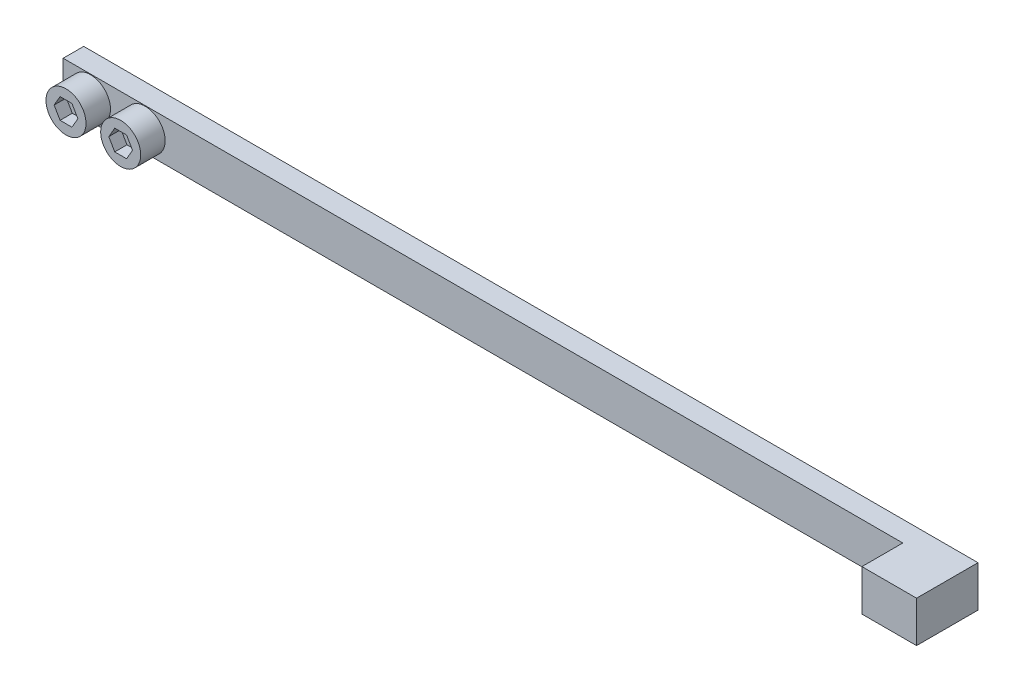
ISO-10303-21;
HEADER;
FILE_DESCRIPTION(('STEP AP214'),'2;1');
FILE_NAME('part.step','',(''),(''),'','','');
FILE_SCHEMA(('AUTOMOTIVE_DESIGN { 1 0 10303 214 1 1 1 1 }'));
ENDSEC;
DATA;
#1=APPLICATION_CONTEXT('core data for automotive mechanical design processes');
#2=APPLICATION_PROTOCOL_DEFINITION('international standard','automotive_design',2000,#1);
#3=PRODUCT_CONTEXT('',#1,'mechanical');
#4=PRODUCT('Part','Part','',(#3));
#5=PRODUCT_RELATED_PRODUCT_CATEGORY('part','',(#4));
#6=PRODUCT_DEFINITION_FORMATION('','',#4);
#7=PRODUCT_DEFINITION_CONTEXT('part definition',#1,'design');
#8=PRODUCT_DEFINITION('design','',#6,#7);
#9=PRODUCT_DEFINITION_SHAPE('','',#8);
#10=(LENGTH_UNIT() NAMED_UNIT(*) SI_UNIT(.MILLI.,.METRE.));
#11=(NAMED_UNIT(*) PLANE_ANGLE_UNIT() SI_UNIT($,.RADIAN.));
#12=(NAMED_UNIT(*) SI_UNIT($,.STERADIAN.) SOLID_ANGLE_UNIT());
#13=UNCERTAINTY_MEASURE_WITH_UNIT(LENGTH_MEASURE(1.E-05),#10,'distance_accuracy_value','');
#14=(GEOMETRIC_REPRESENTATION_CONTEXT(3) GLOBAL_UNCERTAINTY_ASSIGNED_CONTEXT((#13)) GLOBAL_UNIT_ASSIGNED_CONTEXT((#10,
#11,#12)) REPRESENTATION_CONTEXT('',''));
#15=CARTESIAN_POINT('',(0.,0.,0.));
#16=DIRECTION('',(0.,0.,1.));
#17=DIRECTION('',(1.,0.,0.));
#18=AXIS2_PLACEMENT_3D('',#15,#16,#17);
#19=CARTESIAN_POINT('',(-63.8048,2.3876,1.1938));
#20=DIRECTION('',(0.,0.,-1.));
#21=DIRECTION('',(-1.,0.,0.));
#22=AXIS2_PLACEMENT_3D('',#19,#20,#21);
#23=PLANE('',#22);
#24=CARTESIAN_POINT('',(-60.6298,0.,1.1938));
#25=DIRECTION('',(0.,0.,-1.));
#26=DIRECTION('',(-1.,0.,0.));
#27=AXIS2_PLACEMENT_3D('',#24,#25,#26);
#28=CIRCLE('',#27,2.3241);
#29=CARTESIAN_POINT('',(-62.9539,0.,1.1938));
#30=VERTEX_POINT('',#29);
#31=EDGE_CURVE('E41',#30,#30,#28,.F.);
#32=ORIENTED_EDGE('',*,*,#31,.F.);
#33=EDGE_LOOP('',(#32));
#34=FACE_BOUND('',#33,.T.);
#35=DIRECTION('',(1.,0.,0.));
#36=VECTOR('',#35,1.);
#37=CARTESIAN_POINT('',(-63.8048,-2.3876,1.1938));
#38=LINE('',#37,#36);
#39=CARTESIAN_POINT('',(-63.8048,-2.3876,1.1938));
#40=VERTEX_POINT('',#39);
#41=CARTESIAN_POINT('',(33.7312,-2.3876,1.1938));
#42=VERTEX_POINT('',#41);
#43=EDGE_CURVE('E284',#40,#42,#38,.T.);
#44=ORIENTED_EDGE('',*,*,#43,.T.);
#45=DIRECTION('',(0.,-1.,0.));
#46=VECTOR('',#45,1.);
#47=CARTESIAN_POINT('',(33.7312,2.3876,1.1938));
#48=LINE('',#47,#46);
#49=CARTESIAN_POINT('',(33.7312,2.3876,1.1938));
#50=VERTEX_POINT('',#49);
#51=EDGE_CURVE('E299',#50,#42,#48,.T.);
#52=ORIENTED_EDGE('',*,*,#51,.F.);
#53=DIRECTION('',(1.,0.,0.));
#54=VECTOR('',#53,1.);
#55=CARTESIAN_POINT('',(-63.8048,2.3876,1.1938));
#56=LINE('',#55,#54);
#57=CARTESIAN_POINT('',(-63.8048,2.3876,1.1938));
#58=VERTEX_POINT('',#57);
#59=EDGE_CURVE('E271',#58,#50,#56,.T.);
#60=ORIENTED_EDGE('',*,*,#59,.F.);
#61=DIRECTION('',(0.,-1.,0.));
#62=VECTOR('',#61,1.);
#63=CARTESIAN_POINT('',(-63.8048,2.3876,1.1938));
#64=LINE('',#63,#62);
#65=EDGE_CURVE('E302',#58,#40,#64,.T.);
#66=ORIENTED_EDGE('',*,*,#65,.T.);
#67=EDGE_LOOP('',(#44,#52,#60,#66));
#68=FACE_BOUND('',#67,.T.);
#69=CARTESIAN_POINT('',(-54.2798,0.,1.1938));
#70=DIRECTION('',(0.,0.,-1.));
#71=DIRECTION('',(-1.,0.,0.));
#72=AXIS2_PLACEMENT_3D('',#69,#70,#71);
#73=CIRCLE('',#72,2.3241);
#74=CARTESIAN_POINT('',(-56.6039,0.,1.1938));
#75=VERTEX_POINT('',#74);
#76=EDGE_CURVE('E11',#75,#75,#73,.F.);
#77=ORIENTED_EDGE('',*,*,#76,.F.);
#78=EDGE_LOOP('',(#77));
#79=FACE_BOUND('',#78,.T.);
#80=ADVANCED_FACE('F33',(#34,#68,#79),#23,.F.);
#81=CARTESIAN_POINT('',(40.0812,2.3876,-1.1938));
#82=DIRECTION('',(0.,0.,1.));
#83=DIRECTION('',(1.,0.,0.));
#84=AXIS2_PLACEMENT_3D('',#81,#82,#83);
#85=PLANE('',#84);
#86=DIRECTION('',(-1.,0.,0.));
#87=VECTOR('',#86,1.);
#88=CARTESIAN_POINT('',(40.0812,-2.3876,-1.1938));
#89=LINE('',#88,#87);
#90=CARTESIAN_POINT('',(40.0812,-2.3876,-1.1938));
#91=VERTEX_POINT('',#90);
#92=CARTESIAN_POINT('',(-63.8048,-2.3876,-1.1938));
#93=VERTEX_POINT('',#92);
#94=EDGE_CURVE('E264',#91,#93,#89,.T.);
#95=ORIENTED_EDGE('',*,*,#94,.T.);
#96=DIRECTION('',(0.,-1.,0.));
#97=VECTOR('',#96,1.);
#98=CARTESIAN_POINT('',(-63.8048,2.3876,-1.1938));
#99=LINE('',#98,#97);
#100=CARTESIAN_POINT('',(-63.8048,2.3876,-1.1938));
#101=VERTEX_POINT('',#100);
#102=EDGE_CURVE('E305',#101,#93,#99,.T.);
#103=ORIENTED_EDGE('',*,*,#102,.F.);
#104=DIRECTION('',(-1.,0.,0.));
#105=VECTOR('',#104,1.);
#106=CARTESIAN_POINT('',(40.0812,2.3876,-1.1938));
#107=LINE('',#106,#105);
#108=CARTESIAN_POINT('',(40.0812,2.3876,-1.1938));
#109=VERTEX_POINT('',#108);
#110=EDGE_CURVE('E265',#109,#101,#107,.T.);
#111=ORIENTED_EDGE('',*,*,#110,.F.);
#112=DIRECTION('',(0.,-1.,0.));
#113=VECTOR('',#112,1.);
#114=CARTESIAN_POINT('',(40.0812,2.3876,-1.1938));
#115=LINE('',#114,#113);
#116=EDGE_CURVE('E279',#109,#91,#115,.T.);
#117=ORIENTED_EDGE('',*,*,#116,.T.);
#118=EDGE_LOOP('',(#95,#103,#111,#117));
#119=FACE_BOUND('',#118,.T.);
#120=ADVANCED_FACE('F35',(#119),#85,.F.);
#121=CARTESIAN_POINT('',(-63.8048,2.3876,-1.1938));
#122=DIRECTION('',(1.,0.,0.));
#123=DIRECTION('',(0.,0.,-1.));
#124=AXIS2_PLACEMENT_3D('',#121,#122,#123);
#125=PLANE('',#124);
#126=DIRECTION('',(0.,0.,1.));
#127=VECTOR('',#126,1.);
#128=CARTESIAN_POINT('',(-63.8048,-2.3876,-1.1938));
#129=LINE('',#128,#127);
#130=EDGE_CURVE('E282',#93,#40,#129,.T.);
#131=ORIENTED_EDGE('',*,*,#130,.T.);
#132=ORIENTED_EDGE('',*,*,#65,.F.);
#133=DIRECTION('',(0.,0.,1.));
#134=VECTOR('',#133,1.);
#135=CARTESIAN_POINT('',(-63.8048,2.3876,-1.1938));
#136=LINE('',#135,#134);
#137=EDGE_CURVE('E268',#101,#58,#136,.T.);
#138=ORIENTED_EDGE('',*,*,#137,.F.);
#139=ORIENTED_EDGE('',*,*,#102,.T.);
#140=EDGE_LOOP('',(#131,#132,#138,#139));
#141=FACE_BOUND('',#140,.T.);
#142=ADVANCED_FACE('F359',(#141),#125,.F.);
#143=CARTESIAN_POINT('',(33.7312,2.3876,1.1938));
#144=DIRECTION('',(1.,0.,0.));
#145=DIRECTION('',(0.,0.,-1.));
#146=AXIS2_PLACEMENT_3D('',#143,#144,#145);
#147=PLANE('',#146);
#148=DIRECTION('',(0.,0.,1.));
#149=VECTOR('',#148,1.);
#150=CARTESIAN_POINT('',(33.7312,-2.3876,1.1938));
#151=LINE('',#150,#149);
#152=CARTESIAN_POINT('',(33.7312,-2.3876,5.9436));
#153=VERTEX_POINT('',#152);
#154=EDGE_CURVE('E286',#42,#153,#151,.T.);
#155=ORIENTED_EDGE('',*,*,#154,.T.);
#156=DIRECTION('',(0.,-1.,0.));
#157=VECTOR('',#156,1.);
#158=CARTESIAN_POINT('',(33.7312,2.3876,5.9436));
#159=LINE('',#158,#157);
#160=CARTESIAN_POINT('',(33.7312,2.3876,5.9436));
#161=VERTEX_POINT('',#160);
#162=EDGE_CURVE('E296',#161,#153,#159,.T.);
#163=ORIENTED_EDGE('',*,*,#162,.F.);
#164=DIRECTION('',(0.,0.,1.));
#165=VECTOR('',#164,1.);
#166=CARTESIAN_POINT('',(33.7312,2.3876,1.1938));
#167=LINE('',#166,#165);
#168=EDGE_CURVE('E273',#50,#161,#167,.T.);
#169=ORIENTED_EDGE('',*,*,#168,.F.);
#170=ORIENTED_EDGE('',*,*,#51,.T.);
#171=EDGE_LOOP('',(#155,#163,#169,#170));
#172=FACE_BOUND('',#171,.T.);
#173=ADVANCED_FACE('F356',(#172),#147,.F.);
#174=CARTESIAN_POINT('',(33.7312,2.3876,5.9436));
#175=DIRECTION('',(0.,0.,-1.));
#176=DIRECTION('',(-1.,0.,0.));
#177=AXIS2_PLACEMENT_3D('',#174,#175,#176);
#178=PLANE('',#177);
#179=DIRECTION('',(1.,0.,0.));
#180=VECTOR('',#179,1.);
#181=CARTESIAN_POINT('',(33.7312,-2.3876,5.9436));
#182=LINE('',#181,#180);
#183=CARTESIAN_POINT('',(40.0812,-2.3876,5.9436));
#184=VERTEX_POINT('',#183);
#185=EDGE_CURVE('E288',#153,#184,#182,.T.);
#186=ORIENTED_EDGE('',*,*,#185,.T.);
#187=DIRECTION('',(0.,-1.,0.));
#188=VECTOR('',#187,1.);
#189=CARTESIAN_POINT('',(40.0812,2.3876,5.9436));
#190=LINE('',#189,#188);
#191=CARTESIAN_POINT('',(40.0812,2.3876,5.9436));
#192=VERTEX_POINT('',#191);
#193=EDGE_CURVE('E293',#192,#184,#190,.T.);
#194=ORIENTED_EDGE('',*,*,#193,.F.);
#195=DIRECTION('',(1.,0.,0.));
#196=VECTOR('',#195,1.);
#197=CARTESIAN_POINT('',(33.7312,2.3876,5.9436));
#198=LINE('',#197,#196);
#199=EDGE_CURVE('E275',#161,#192,#198,.T.);
#200=ORIENTED_EDGE('',*,*,#199,.F.);
#201=ORIENTED_EDGE('',*,*,#162,.T.);
#202=EDGE_LOOP('',(#186,#194,#200,#201));
#203=FACE_BOUND('',#202,.T.);
#204=ADVANCED_FACE('F352',(#203),#178,.F.);
#205=CARTESIAN_POINT('',(40.0812,2.3876,5.9436));
#206=DIRECTION('',(-1.,0.,0.));
#207=DIRECTION('',(0.,0.,1.));
#208=AXIS2_PLACEMENT_3D('',#205,#206,#207);
#209=PLANE('',#208);
#210=DIRECTION('',(0.,0.,-1.));
#211=VECTOR('',#210,1.);
#212=CARTESIAN_POINT('',(40.0812,-2.3876,5.9436));
#213=LINE('',#212,#211);
#214=EDGE_CURVE('E269',#184,#91,#213,.T.);
#215=ORIENTED_EDGE('',*,*,#214,.T.);
#216=ORIENTED_EDGE('',*,*,#116,.F.);
#217=DIRECTION('',(0.,0.,-1.));
#218=VECTOR('',#217,1.);
#219=CARTESIAN_POINT('',(40.0812,2.3876,5.9436));
#220=LINE('',#219,#218);
#221=EDGE_CURVE('E277',#192,#109,#220,.T.);
#222=ORIENTED_EDGE('',*,*,#221,.F.);
#223=ORIENTED_EDGE('',*,*,#193,.T.);
#224=EDGE_LOOP('',(#215,#216,#222,#223));
#225=FACE_BOUND('',#224,.T.);
#226=ADVANCED_FACE('F345',(#225),#209,.F.);
#227=CARTESIAN_POINT('',(-63.8048,2.3876,-1.1938));
#228=DIRECTION('',(0.,1.,0.));
#229=DIRECTION('',(0.,0.,1.));
#230=AXIS2_PLACEMENT_3D('',#227,#228,#229);
#231=PLANE('',#230);
#232=ORIENTED_EDGE('',*,*,#110,.T.);
#233=ORIENTED_EDGE('',*,*,#137,.T.);
#234=ORIENTED_EDGE('',*,*,#59,.T.);
#235=ORIENTED_EDGE('',*,*,#168,.T.);
#236=ORIENTED_EDGE('',*,*,#199,.T.);
#237=ORIENTED_EDGE('',*,*,#221,.T.);
#238=EDGE_LOOP('',(#232,#233,#234,#235,#236,#237));
#239=FACE_BOUND('',#238,.T.);
#240=ADVANCED_FACE('F342',(#239),#231,.T.);
#241=CARTESIAN_POINT('',(-63.8048,-2.3876,-1.1938));
#242=DIRECTION('',(0.,1.,0.));
#243=DIRECTION('',(0.,0.,1.));
#244=AXIS2_PLACEMENT_3D('',#241,#242,#243);
#245=PLANE('',#244);
#246=ORIENTED_EDGE('',*,*,#94,.F.);
#247=ORIENTED_EDGE('',*,*,#214,.F.);
#248=ORIENTED_EDGE('',*,*,#185,.F.);
#249=ORIENTED_EDGE('',*,*,#154,.F.);
#250=ORIENTED_EDGE('',*,*,#43,.F.);
#251=ORIENTED_EDGE('',*,*,#130,.F.);
#252=EDGE_LOOP('',(#246,#247,#248,#249,#250,#251));
#253=FACE_BOUND('',#252,.T.);
#254=ADVANCED_FACE('F340',(#253),#245,.F.);
#255=CARTESIAN_POINT('',(-60.6298,0.,4.0386));
#256=DIRECTION('',(0.,0.,-1.));
#257=DIRECTION('',(-1.,0.,0.));
#258=AXIS2_PLACEMENT_3D('',#255,#256,#257);
#259=CYLINDRICAL_SURFACE('',#258,2.3241);
#260=CARTESIAN_POINT('',(-60.6298,0.,4.0386));
#261=DIRECTION('',(0.,0.,1.));
#262=DIRECTION('',(1.,0.,0.));
#263=AXIS2_PLACEMENT_3D('',#260,#261,#262);
#264=CIRCLE('',#263,2.3241);
#265=CARTESIAN_POINT('',(-58.3057,0.,4.0386));
#266=VERTEX_POINT('',#265);
#267=EDGE_CURVE('E261',#266,#266,#264,.T.);
#268=ORIENTED_EDGE('',*,*,#267,.F.);
#269=EDGE_LOOP('',(#268));
#270=FACE_BOUND('',#269,.T.);
#271=ORIENTED_EDGE('',*,*,#31,.T.);
#272=EDGE_LOOP('',(#271));
#273=FACE_BOUND('',#272,.T.);
#274=ADVANCED_FACE('F310',(#270,#273),#259,.T.);
#275=CARTESIAN_POINT('',(-60.6298,0.,4.0386));
#276=DIRECTION('',(0.,0.,1.));
#277=DIRECTION('',(1.,0.,0.));
#278=AXIS2_PLACEMENT_3D('',#275,#276,#277);
#279=PLANE('',#278);
#280=DIRECTION('',(-0.499999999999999,-0.866025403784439,0.));
#281=VECTOR('',#280,1.);
#282=CARTESIAN_POINT('',(-64.102079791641,-3.62656501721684,4.0386));
#283=LINE('',#282,#281);
#284=CARTESIAN_POINT('',(-61.3190407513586,1.1938,4.0386));
#285=VERTEX_POINT('',#284);
#286=CARTESIAN_POINT('',(-62.0082815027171,0.,4.0386));
#287=VERTEX_POINT('',#286);
#288=EDGE_CURVE('E56',#285,#287,#283,.T.);
#289=ORIENTED_EDGE('',*,*,#288,.F.);
#290=DIRECTION('',(-1.,0.,0.));
#291=VECTOR('',#290,1.);
#292=CARTESIAN_POINT('',(-57.4548,1.1938,4.0386));
#293=LINE('',#292,#291);
#294=CARTESIAN_POINT('',(-59.9405592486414,1.1938,4.0386));
#295=VERTEX_POINT('',#294);
#296=EDGE_CURVE('E216',#295,#285,#293,.T.);
#297=ORIENTED_EDGE('',*,*,#296,.F.);
#298=DIRECTION('',(-0.500000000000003,0.866025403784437,0.));
#299=VECTOR('',#298,1.);
#300=CARTESIAN_POINT('',(-55.570020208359,-6.3761956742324,4.0386));
#301=LINE('',#300,#299);
#302=CARTESIAN_POINT('',(-59.2513184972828,0.,4.0386));
#303=VERTEX_POINT('',#302);
#304=EDGE_CURVE('E242',#303,#295,#301,.T.);
#305=ORIENTED_EDGE('',*,*,#304,.F.);
#306=DIRECTION('',(0.500000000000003,0.866025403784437,0.));
#307=VECTOR('',#306,1.);
#308=CARTESIAN_POINT('',(-62.0343575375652,-4.82036501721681,4.0386));
#309=LINE('',#308,#307);
#310=CARTESIAN_POINT('',(-59.9405592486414,-1.1938,4.0386));
#311=VERTEX_POINT('',#310);
#312=EDGE_CURVE('E239',#311,#303,#309,.T.);
#313=ORIENTED_EDGE('',*,*,#312,.F.);
#314=DIRECTION('',(1.,0.,0.));
#315=VECTOR('',#314,1.);
#316=CARTESIAN_POINT('',(-57.4548,-1.1938,4.0386));
#317=LINE('',#316,#315);
#318=CARTESIAN_POINT('',(-61.3190407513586,-1.1938,4.0386));
#319=VERTEX_POINT('',#318);
#320=EDGE_CURVE('E236',#319,#311,#317,.T.);
#321=ORIENTED_EDGE('',*,*,#320,.F.);
#322=DIRECTION('',(0.499999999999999,-0.86602540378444,0.));
#323=VECTOR('',#322,1.);
#324=CARTESIAN_POINT('',(-57.6377424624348,-7.56999567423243,4.0386));
#325=LINE('',#324,#323);
#326=EDGE_CURVE('E233',#287,#319,#325,.T.);
#327=ORIENTED_EDGE('',*,*,#326,.F.);
#328=EDGE_LOOP('',(#289,#297,#305,#313,#321,#327));
#329=FACE_BOUND('',#328,.T.);
#330=ORIENTED_EDGE('',*,*,#267,.T.);
#331=EDGE_LOOP('',(#330));
#332=FACE_BOUND('',#331,.T.);
#333=ADVANCED_FACE('F323',(#329,#332),#279,.T.);
#334=CARTESIAN_POINT('',(-54.2798,0.,4.0386));
#335=DIRECTION('',(0.,0.,-1.));
#336=DIRECTION('',(-1.,0.,0.));
#337=AXIS2_PLACEMENT_3D('',#334,#335,#336);
#338=CYLINDRICAL_SURFACE('',#337,2.3241);
#339=CARTESIAN_POINT('',(-54.2798,0.,4.0386));
#340=DIRECTION('',(0.,0.,1.));
#341=DIRECTION('',(1.,0.,0.));
#342=AXIS2_PLACEMENT_3D('',#339,#340,#341);
#343=CIRCLE('',#342,2.3241);
#344=CARTESIAN_POINT('',(-51.9557,0.,4.0386));
#345=VERTEX_POINT('',#344);
#346=EDGE_CURVE('E249',#345,#345,#343,.T.);
#347=ORIENTED_EDGE('',*,*,#346,.F.);
#348=EDGE_LOOP('',(#347));
#349=FACE_BOUND('',#348,.T.);
#350=ORIENTED_EDGE('',*,*,#76,.T.);
#351=EDGE_LOOP('',(#350));
#352=FACE_BOUND('',#351,.T.);
#353=ADVANCED_FACE('F320',(#349,#352),#338,.T.);
#354=CARTESIAN_POINT('',(-54.2798,0.,4.0386));
#355=DIRECTION('',(0.,0.,1.));
#356=DIRECTION('',(1.,0.,0.));
#357=AXIS2_PLACEMENT_3D('',#354,#355,#356);
#358=PLANE('',#357);
#359=DIRECTION('',(0.499999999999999,-0.866025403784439,0.));
#360=VECTOR('',#359,1.);
#361=CARTESIAN_POINT('',(-52.8752424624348,-4.82036501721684,4.0386));
#362=LINE('',#361,#360);
#363=CARTESIAN_POINT('',(-55.6582815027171,0.,4.0386));
#364=VERTEX_POINT('',#363);
#365=CARTESIAN_POINT('',(-54.9690407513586,-1.1938,4.0386));
#366=VERTEX_POINT('',#365);
#367=EDGE_CURVE('E48',#364,#366,#362,.T.);
#368=ORIENTED_EDGE('',*,*,#367,.F.);
#369=DIRECTION('',(-0.499999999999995,-0.866025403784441,0.));
#370=VECTOR('',#369,1.);
#371=CARTESIAN_POINT('',(-59.3395797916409,-6.37619567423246,4.0386));
#372=LINE('',#371,#370);
#373=CARTESIAN_POINT('',(-54.9690407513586,1.1938,4.0386));
#374=VERTEX_POINT('',#373);
#375=EDGE_CURVE('E179',#374,#364,#372,.T.);
#376=ORIENTED_EDGE('',*,*,#375,.F.);
#377=DIRECTION('',(-1.,0.,0.));
#378=VECTOR('',#377,1.);
#379=CARTESIAN_POINT('',(-57.4548,1.1938,4.0386));
#380=LINE('',#379,#378);
#381=CARTESIAN_POINT('',(-53.5905592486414,1.1938,4.0386));
#382=VERTEX_POINT('',#381);
#383=EDGE_CURVE('E182',#382,#374,#380,.T.);
#384=ORIENTED_EDGE('',*,*,#383,.F.);
#385=DIRECTION('',(-0.499999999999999,0.866025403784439,0.));
#386=VECTOR('',#385,1.);
#387=CARTESIAN_POINT('',(-50.807520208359,-3.62656501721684,4.0386));
#388=LINE('',#387,#386);
#389=CARTESIAN_POINT('',(-52.9013184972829,0.,4.0386));
#390=VERTEX_POINT('',#389);
#391=EDGE_CURVE('E198',#390,#382,#388,.T.);
#392=ORIENTED_EDGE('',*,*,#391,.F.);
#393=DIRECTION('',(0.499999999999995,0.866025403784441,0.));
#394=VECTOR('',#393,1.);
#395=CARTESIAN_POINT('',(-57.2718575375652,-7.56999567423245,4.0386));
#396=LINE('',#395,#394);
#397=CARTESIAN_POINT('',(-53.5905592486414,-1.1938,4.0386));
#398=VERTEX_POINT('',#397);
#399=EDGE_CURVE('E195',#398,#390,#396,.T.);
#400=ORIENTED_EDGE('',*,*,#399,.F.);
#401=DIRECTION('',(1.,0.,0.));
#402=VECTOR('',#401,1.);
#403=CARTESIAN_POINT('',(-57.4548,-1.1938,4.0386));
#404=LINE('',#403,#402);
#405=EDGE_CURVE('E193',#366,#398,#404,.T.);
#406=ORIENTED_EDGE('',*,*,#405,.F.);
#407=EDGE_LOOP('',(#368,#376,#384,#392,#400,#406));
#408=FACE_BOUND('',#407,.T.);
#409=ORIENTED_EDGE('',*,*,#346,.T.);
#410=EDGE_LOOP('',(#409));
#411=FACE_BOUND('',#410,.T.);
#412=ADVANCED_FACE('F322',(#408,#411),#358,.T.);
#413=CARTESIAN_POINT('',(-64.102079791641,-3.62656501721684,2.6162));
#414=DIRECTION('',(-0.866025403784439,0.499999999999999,0.));
#415=DIRECTION('',(-0.499999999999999,-0.866025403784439,0.));
#416=AXIS2_PLACEMENT_3D('',#413,#414,#415);
#417=PLANE('',#416);
#418=ORIENTED_EDGE('',*,*,#288,.T.);
#419=DIRECTION('',(0.,0.,1.));
#420=VECTOR('',#419,1.);
#421=CARTESIAN_POINT('',(-62.0082815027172,0.,2.6162));
#422=LINE('',#421,#420);
#423=CARTESIAN_POINT('',(-62.0082815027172,0.,2.6162));
#424=VERTEX_POINT('',#423);
#425=EDGE_CURVE('E231',#424,#287,#422,.T.);
#426=ORIENTED_EDGE('',*,*,#425,.F.);
#427=DIRECTION('',(-0.499999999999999,-0.866025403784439,0.));
#428=VECTOR('',#427,1.);
#429=CARTESIAN_POINT('',(-64.102079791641,-3.62656501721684,2.6162));
#430=LINE('',#429,#428);
#431=CARTESIAN_POINT('',(-61.3190407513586,1.1938,2.6162));
#432=VERTEX_POINT('',#431);
#433=EDGE_CURVE('E212',#432,#424,#430,.T.);
#434=ORIENTED_EDGE('',*,*,#433,.F.);
#435=DIRECTION('',(0.,0.,1.));
#436=VECTOR('',#435,1.);
#437=CARTESIAN_POINT('',(-61.3190407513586,1.1938,2.6162));
#438=LINE('',#437,#436);
#439=EDGE_CURVE('E247',#432,#285,#438,.T.);
#440=ORIENTED_EDGE('',*,*,#439,.T.);
#441=EDGE_LOOP('',(#418,#426,#434,#440));
#442=FACE_BOUND('',#441,.T.);
#443=ADVANCED_FACE('F330',(#442),#417,.F.);
#444=CARTESIAN_POINT('',(-57.4548,1.1938,2.6162));
#445=DIRECTION('',(0.,1.,0.));
#446=DIRECTION('',(0.,0.,1.));
#447=AXIS2_PLACEMENT_3D('',#444,#445,#446);
#448=PLANE('',#447);
#449=ORIENTED_EDGE('',*,*,#296,.T.);
#450=ORIENTED_EDGE('',*,*,#439,.F.);
#451=DIRECTION('',(-1.,0.,0.));
#452=VECTOR('',#451,1.);
#453=CARTESIAN_POINT('',(-57.4548,1.1938,2.6162));
#454=LINE('',#453,#452);
#455=CARTESIAN_POINT('',(-59.9405592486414,1.1938,2.6162));
#456=VERTEX_POINT('',#455);
#457=EDGE_CURVE('E228',#456,#432,#454,.T.);
#458=ORIENTED_EDGE('',*,*,#457,.F.);
#459=DIRECTION('',(0.,0.,1.));
#460=VECTOR('',#459,1.);
#461=CARTESIAN_POINT('',(-59.9405592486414,1.1938,2.6162));
#462=LINE('',#461,#460);
#463=EDGE_CURVE('E250',#456,#295,#462,.T.);
#464=ORIENTED_EDGE('',*,*,#463,.T.);
#465=EDGE_LOOP('',(#449,#450,#458,#464));
#466=FACE_BOUND('',#465,.T.);
#467=ADVANCED_FACE('F422',(#466),#448,.F.);
#468=CARTESIAN_POINT('',(-55.570020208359,-6.3761956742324,2.6162));
#469=DIRECTION('',(0.866025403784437,0.500000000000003,0.));
#470=DIRECTION('',(-0.500000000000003,0.866025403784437,0.));
#471=AXIS2_PLACEMENT_3D('',#468,#469,#470);
#472=PLANE('',#471);
#473=ORIENTED_EDGE('',*,*,#304,.T.);
#474=ORIENTED_EDGE('',*,*,#463,.F.);
#475=DIRECTION('',(-0.500000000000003,0.866025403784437,0.));
#476=VECTOR('',#475,1.);
#477=CARTESIAN_POINT('',(-55.570020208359,-6.3761956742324,2.6162));
#478=LINE('',#477,#476);
#479=CARTESIAN_POINT('',(-59.2513184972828,0.,2.6162));
#480=VERTEX_POINT('',#479);
#481=EDGE_CURVE('E225',#480,#456,#478,.T.);
#482=ORIENTED_EDGE('',*,*,#481,.F.);
#483=DIRECTION('',(0.,0.,1.));
#484=VECTOR('',#483,1.);
#485=CARTESIAN_POINT('',(-59.2513184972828,0.,2.6162));
#486=LINE('',#485,#484);
#487=EDGE_CURVE('E252',#480,#303,#486,.T.);
#488=ORIENTED_EDGE('',*,*,#487,.T.);
#489=EDGE_LOOP('',(#473,#474,#482,#488));
#490=FACE_BOUND('',#489,.T.);
#491=ADVANCED_FACE('F430',(#490),#472,.F.);
#492=CARTESIAN_POINT('',(-62.0343575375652,-4.82036501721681,2.6162));
#493=DIRECTION('',(0.866025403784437,-0.500000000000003,0.));
#494=DIRECTION('',(0.500000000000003,0.866025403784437,0.));
#495=AXIS2_PLACEMENT_3D('',#492,#493,#494);
#496=PLANE('',#495);
#497=ORIENTED_EDGE('',*,*,#312,.T.);
#498=ORIENTED_EDGE('',*,*,#487,.F.);
#499=DIRECTION('',(0.500000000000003,0.866025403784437,0.));
#500=VECTOR('',#499,1.);
#501=CARTESIAN_POINT('',(-62.0343575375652,-4.82036501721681,2.6162));
#502=LINE('',#501,#500);
#503=CARTESIAN_POINT('',(-59.9405592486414,-1.1938,2.6162));
#504=VERTEX_POINT('',#503);
#505=EDGE_CURVE('E222',#504,#480,#502,.T.);
#506=ORIENTED_EDGE('',*,*,#505,.F.);
#507=DIRECTION('',(0.,0.,1.));
#508=VECTOR('',#507,1.);
#509=CARTESIAN_POINT('',(-59.9405592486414,-1.1938,2.6162));
#510=LINE('',#509,#508);
#511=EDGE_CURVE('E254',#504,#311,#510,.T.);
#512=ORIENTED_EDGE('',*,*,#511,.T.);
#513=EDGE_LOOP('',(#497,#498,#506,#512));
#514=FACE_BOUND('',#513,.T.);
#515=ADVANCED_FACE('F440',(#514),#496,.F.);
#516=CARTESIAN_POINT('',(-57.4548,-1.1938,2.6162));
#517=DIRECTION('',(0.,-1.,0.));
#518=DIRECTION('',(0.,0.,-1.));
#519=AXIS2_PLACEMENT_3D('',#516,#517,#518);
#520=PLANE('',#519);
#521=ORIENTED_EDGE('',*,*,#320,.T.);
#522=ORIENTED_EDGE('',*,*,#511,.F.);
#523=DIRECTION('',(1.,0.,0.));
#524=VECTOR('',#523,1.);
#525=CARTESIAN_POINT('',(-57.4548,-1.1938,2.6162));
#526=LINE('',#525,#524);
#527=CARTESIAN_POINT('',(-61.3190407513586,-1.1938,2.6162));
#528=VERTEX_POINT('',#527);
#529=EDGE_CURVE('E219',#528,#504,#526,.T.);
#530=ORIENTED_EDGE('',*,*,#529,.F.);
#531=DIRECTION('',(0.,0.,1.));
#532=VECTOR('',#531,1.);
#533=CARTESIAN_POINT('',(-61.3190407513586,-1.1938,2.6162));
#534=LINE('',#533,#532);
#535=EDGE_CURVE('E256',#528,#319,#534,.T.);
#536=ORIENTED_EDGE('',*,*,#535,.T.);
#537=EDGE_LOOP('',(#521,#522,#530,#536));
#538=FACE_BOUND('',#537,.T.);
#539=ADVANCED_FACE('F450',(#538),#520,.F.);
#540=CARTESIAN_POINT('',(-57.6377424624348,-7.56999567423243,2.6162));
#541=DIRECTION('',(-0.866025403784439,-0.499999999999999,0.));
#542=DIRECTION('',(0.499999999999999,-0.866025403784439,0.));
#543=AXIS2_PLACEMENT_3D('',#540,#541,#542);
#544=PLANE('',#543);
#545=ORIENTED_EDGE('',*,*,#326,.T.);
#546=ORIENTED_EDGE('',*,*,#535,.F.);
#547=DIRECTION('',(0.499999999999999,-0.86602540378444,0.));
#548=VECTOR('',#547,1.);
#549=CARTESIAN_POINT('',(-57.6377424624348,-7.56999567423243,2.6162));
#550=LINE('',#549,#548);
#551=EDGE_CURVE('E215',#424,#528,#550,.T.);
#552=ORIENTED_EDGE('',*,*,#551,.F.);
#553=ORIENTED_EDGE('',*,*,#425,.T.);
#554=EDGE_LOOP('',(#545,#546,#552,#553));
#555=FACE_BOUND('',#554,.T.);
#556=ADVANCED_FACE('F460',(#555),#544,.F.);
#557=CARTESIAN_POINT('',(-57.4548,-7.4643737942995,2.6162));
#558=DIRECTION('',(0.,0.,1.));
#559=DIRECTION('',(1.,0.,0.));
#560=AXIS2_PLACEMENT_3D('',#557,#558,#559);
#561=PLANE('',#560);
#562=ORIENTED_EDGE('',*,*,#433,.T.);
#563=ORIENTED_EDGE('',*,*,#551,.T.);
#564=ORIENTED_EDGE('',*,*,#529,.T.);
#565=ORIENTED_EDGE('',*,*,#505,.T.);
#566=ORIENTED_EDGE('',*,*,#481,.T.);
#567=ORIENTED_EDGE('',*,*,#457,.T.);
#568=EDGE_LOOP('',(#562,#563,#564,#565,#566,#567));
#569=FACE_BOUND('',#568,.T.);
#570=ADVANCED_FACE('F470',(#569),#561,.T.);
#571=CARTESIAN_POINT('',(-52.8752424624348,-4.82036501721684,2.6162));
#572=DIRECTION('',(-0.866025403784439,-0.499999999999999,0.));
#573=DIRECTION('',(0.499999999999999,-0.866025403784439,0.));
#574=AXIS2_PLACEMENT_3D('',#571,#572,#573);
#575=PLANE('',#574);
#576=ORIENTED_EDGE('',*,*,#367,.T.);
#577=DIRECTION('',(0.,0.,1.));
#578=VECTOR('',#577,1.);
#579=CARTESIAN_POINT('',(-54.9690407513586,-1.1938,2.6162));
#580=LINE('',#579,#578);
#581=CARTESIAN_POINT('',(-54.9690407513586,-1.1938,2.6162));
#582=VERTEX_POINT('',#581);
#583=EDGE_CURVE('E156',#582,#366,#580,.T.);
#584=ORIENTED_EDGE('',*,*,#583,.F.);
#585=DIRECTION('',(0.499999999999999,-0.866025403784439,0.));
#586=VECTOR('',#585,1.);
#587=CARTESIAN_POINT('',(-52.8752424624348,-4.82036501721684,2.6162));
#588=LINE('',#587,#586);
#589=CARTESIAN_POINT('',(-55.6582815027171,0.,2.6162));
#590=VERTEX_POINT('',#589);
#591=EDGE_CURVE('E160',#590,#582,#588,.T.);
#592=ORIENTED_EDGE('',*,*,#591,.F.);
#593=DIRECTION('',(0.,0.,1.));
#594=VECTOR('',#593,1.);
#595=CARTESIAN_POINT('',(-55.6582815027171,0.,2.6162));
#596=LINE('',#595,#594);
#597=EDGE_CURVE('E203',#590,#364,#596,.T.);
#598=ORIENTED_EDGE('',*,*,#597,.T.);
#599=EDGE_LOOP('',(#576,#584,#592,#598));
#600=FACE_BOUND('',#599,.T.);
#601=ADVANCED_FACE('F158',(#600),#575,.F.);
#602=CARTESIAN_POINT('',(-59.3395797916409,-6.37619567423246,2.6162));
#603=DIRECTION('',(-0.866025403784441,0.499999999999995,0.));
#604=DIRECTION('',(-0.499999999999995,-0.866025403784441,0.));
#605=AXIS2_PLACEMENT_3D('',#602,#603,#604);
#606=PLANE('',#605);
#607=ORIENTED_EDGE('',*,*,#375,.T.);
#608=ORIENTED_EDGE('',*,*,#597,.F.);
#609=DIRECTION('',(-0.499999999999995,-0.866025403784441,0.));
#610=VECTOR('',#609,1.);
#611=CARTESIAN_POINT('',(-59.3395797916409,-6.37619567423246,2.6162));
#612=LINE('',#611,#610);
#613=CARTESIAN_POINT('',(-54.9690407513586,1.1938,2.6162));
#614=VERTEX_POINT('',#613);
#615=EDGE_CURVE('E166',#614,#590,#612,.T.);
#616=ORIENTED_EDGE('',*,*,#615,.F.);
#617=DIRECTION('',(0.,0.,1.));
#618=VECTOR('',#617,1.);
#619=CARTESIAN_POINT('',(-54.9690407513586,1.1938,2.6162));
#620=LINE('',#619,#618);
#621=EDGE_CURVE('E205',#614,#374,#620,.T.);
#622=ORIENTED_EDGE('',*,*,#621,.T.);
#623=EDGE_LOOP('',(#607,#608,#616,#622));
#624=FACE_BOUND('',#623,.T.);
#625=ADVANCED_FACE('F489',(#624),#606,.F.);
#626=CARTESIAN_POINT('',(-57.4548,1.1938,2.6162));
#627=DIRECTION('',(0.,1.,0.));
#628=DIRECTION('',(-1.,0.,0.));
#629=AXIS2_PLACEMENT_3D('',#626,#627,#628);
#630=PLANE('',#629);
#631=ORIENTED_EDGE('',*,*,#383,.T.);
#632=ORIENTED_EDGE('',*,*,#621,.F.);
#633=DIRECTION('',(-1.,0.,0.));
#634=VECTOR('',#633,1.);
#635=CARTESIAN_POINT('',(-57.4548,1.1938,2.6162));
#636=LINE('',#635,#634);
#637=CARTESIAN_POINT('',(-53.5905592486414,1.1938,2.6162));
#638=VERTEX_POINT('',#637);
#639=EDGE_CURVE('E189',#638,#614,#636,.T.);
#640=ORIENTED_EDGE('',*,*,#639,.F.);
#641=DIRECTION('',(0.,0.,1.));
#642=VECTOR('',#641,1.);
#643=CARTESIAN_POINT('',(-53.5905592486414,1.1938,2.6162));
#644=LINE('',#643,#642);
#645=EDGE_CURVE('E207',#638,#382,#644,.T.);
#646=ORIENTED_EDGE('',*,*,#645,.T.);
#647=EDGE_LOOP('',(#631,#632,#640,#646));
#648=FACE_BOUND('',#647,.T.);
#649=ADVANCED_FACE('F498',(#648),#630,.F.);
#650=CARTESIAN_POINT('',(-50.807520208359,-3.62656501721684,2.6162));
#651=DIRECTION('',(0.866025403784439,0.499999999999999,0.));
#652=DIRECTION('',(-0.499999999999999,0.866025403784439,0.));
#653=AXIS2_PLACEMENT_3D('',#650,#651,#652);
#654=PLANE('',#653);
#655=ORIENTED_EDGE('',*,*,#391,.T.);
#656=ORIENTED_EDGE('',*,*,#645,.F.);
#657=DIRECTION('',(-0.499999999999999,0.866025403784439,0.));
#658=VECTOR('',#657,1.);
#659=CARTESIAN_POINT('',(-50.807520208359,-3.62656501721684,2.6162));
#660=LINE('',#659,#658);
#661=CARTESIAN_POINT('',(-52.9013184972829,0.,2.6162));
#662=VERTEX_POINT('',#661);
#663=EDGE_CURVE('E186',#662,#638,#660,.T.);
#664=ORIENTED_EDGE('',*,*,#663,.F.);
#665=DIRECTION('',(0.,0.,1.));
#666=VECTOR('',#665,1.);
#667=CARTESIAN_POINT('',(-52.9013184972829,0.,2.6162));
#668=LINE('',#667,#666);
#669=EDGE_CURVE('E209',#662,#390,#668,.T.);
#670=ORIENTED_EDGE('',*,*,#669,.T.);
#671=EDGE_LOOP('',(#655,#656,#664,#670));
#672=FACE_BOUND('',#671,.T.);
#673=ADVANCED_FACE('F508',(#672),#654,.F.);
#674=CARTESIAN_POINT('',(-57.2718575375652,-7.56999567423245,2.6162));
#675=DIRECTION('',(0.866025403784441,-0.499999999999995,0.));
#676=DIRECTION('',(0.499999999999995,0.866025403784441,0.));
#677=AXIS2_PLACEMENT_3D('',#674,#675,#676);
#678=PLANE('',#677);
#679=ORIENTED_EDGE('',*,*,#399,.T.);
#680=ORIENTED_EDGE('',*,*,#669,.F.);
#681=DIRECTION('',(0.499999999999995,0.866025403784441,0.));
#682=VECTOR('',#681,1.);
#683=CARTESIAN_POINT('',(-57.2718575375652,-7.56999567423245,2.6162));
#684=LINE('',#683,#682);
#685=CARTESIAN_POINT('',(-53.5905592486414,-1.1938,2.6162));
#686=VERTEX_POINT('',#685);
#687=EDGE_CURVE('E174',#686,#662,#684,.T.);
#688=ORIENTED_EDGE('',*,*,#687,.F.);
#689=DIRECTION('',(0.,0.,1.));
#690=VECTOR('',#689,1.);
#691=CARTESIAN_POINT('',(-53.5905592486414,-1.1938,2.6162));
#692=LINE('',#691,#690);
#693=EDGE_CURVE('E165',#686,#398,#692,.T.);
#694=ORIENTED_EDGE('',*,*,#693,.T.);
#695=EDGE_LOOP('',(#679,#680,#688,#694));
#696=FACE_BOUND('',#695,.T.);
#697=ADVANCED_FACE('F518',(#696),#678,.F.);
#698=CARTESIAN_POINT('',(-57.4548,-1.1938,2.6162));
#699=DIRECTION('',(0.,-1.,0.));
#700=DIRECTION('',(0.,0.,-1.));
#701=AXIS2_PLACEMENT_3D('',#698,#699,#700);
#702=PLANE('',#701);
#703=ORIENTED_EDGE('',*,*,#405,.T.);
#704=ORIENTED_EDGE('',*,*,#693,.F.);
#705=DIRECTION('',(1.,0.,0.));
#706=VECTOR('',#705,1.);
#707=CARTESIAN_POINT('',(-57.4548,-1.1938,2.6162));
#708=LINE('',#707,#706);
#709=EDGE_CURVE('E169',#582,#686,#708,.T.);
#710=ORIENTED_EDGE('',*,*,#709,.F.);
#711=ORIENTED_EDGE('',*,*,#583,.T.);
#712=EDGE_LOOP('',(#703,#704,#710,#711));
#713=FACE_BOUND('',#712,.T.);
#714=ADVANCED_FACE('F170',(#713),#702,.F.);
#715=CARTESIAN_POINT('',(-57.4548,-7.4643737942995,2.6162));
#716=DIRECTION('',(0.,0.,1.));
#717=DIRECTION('',(1.,0.,0.));
#718=AXIS2_PLACEMENT_3D('',#715,#716,#717);
#719=PLANE('',#718);
#720=ORIENTED_EDGE('',*,*,#591,.T.);
#721=ORIENTED_EDGE('',*,*,#709,.T.);
#722=ORIENTED_EDGE('',*,*,#687,.T.);
#723=ORIENTED_EDGE('',*,*,#663,.T.);
#724=ORIENTED_EDGE('',*,*,#639,.T.);
#725=ORIENTED_EDGE('',*,*,#615,.T.);
#726=EDGE_LOOP('',(#720,#721,#722,#723,#724,#725));
#727=FACE_BOUND('',#726,.T.);
#728=ADVANCED_FACE('F176',(#727),#719,.T.);
#729=CLOSED_SHELL('',(#80,#120,#142,#173,#204,#226,#240,#254,#274,#333,#353,#412,#443,#467,#491,
#515,#539,#556,#570,#601,#625,#649,#673,#697,#714,#728));
#730=MANIFOLD_SOLID_BREP('B2',#729);
#731=ADVANCED_BREP_SHAPE_REPRESENTATION('',(#18,#730),#14);
#732=SHAPE_DEFINITION_REPRESENTATION(#9,#731);
ENDSEC;
END-ISO-10303-21;
